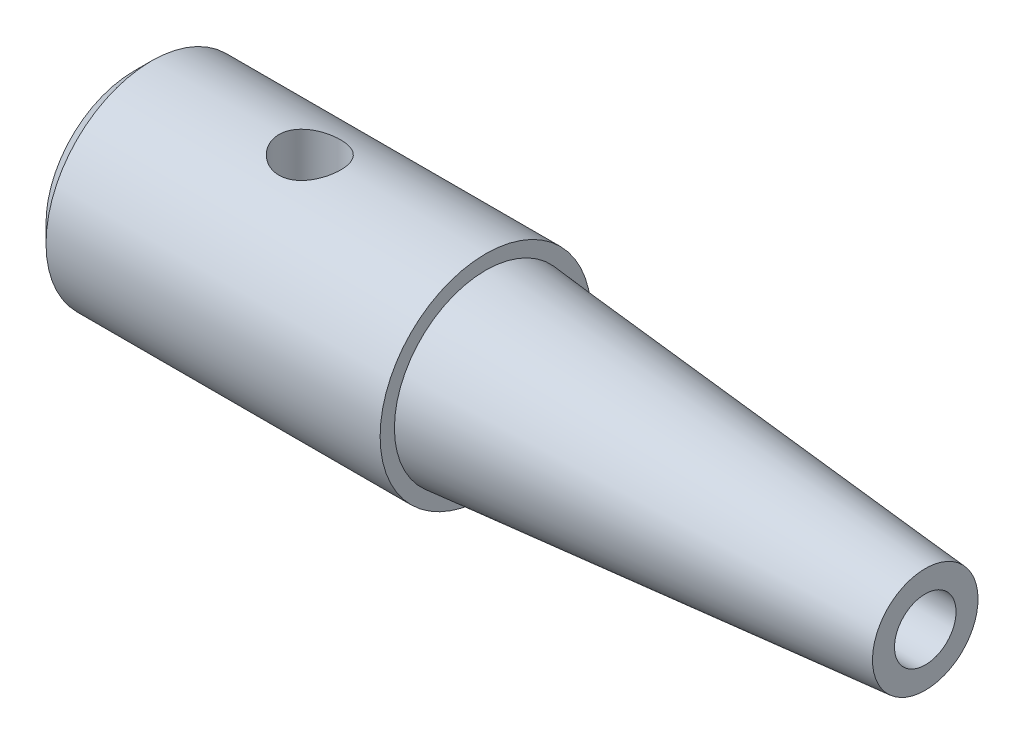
from build123d import *

# Parameters (mm, degrees)
SKETCH2_R          = 1.75
CUT_EXTRUDE1_DEPTH = 10
CHAMFER1_SIZE      = 1


with BuildPart() as part:
    # Sketch1 → Revolve1 (revolve)
    with BuildSketch(Plane.XY, mode=Mode.PRIVATE) as revolve1_sk:
        Polygon((0, 0), (23.989637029, 0), (25, 1.75), (45, 1.75), (45, 3), (20, 5.187216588), (20, 6), (0, 6), align=None)
    revolve(revolve1_sk.sketch.rotate(Axis((0, 0, 0), (1, 0, 0)), 180), axis=Axis((0, 0, 0), (1, 0, 0)))

    # Sketch2 → Cut-Extrude1 (cut, symmetric)
    with BuildSketch(Plane(origin=(0, 0, 0), x_dir=(1, 0, 0), z_dir=(0, 1, 0))):
        with Locations(Location((10, 0, 0), (0, 0, 270))):
            Circle(SKETCH2_R)
    extrude(amount=CUT_EXTRUDE1_DEPTH, both=True, mode=Mode.SUBTRACT)

    # Chamfer1
    chamfer1_edges = [part.edges().sort_by_distance(p)[0] for p in [
        (0, 6, 0),
    ]]
    chamfer(chamfer1_edges, length=CHAMFER1_SIZE)


solid = part.part
